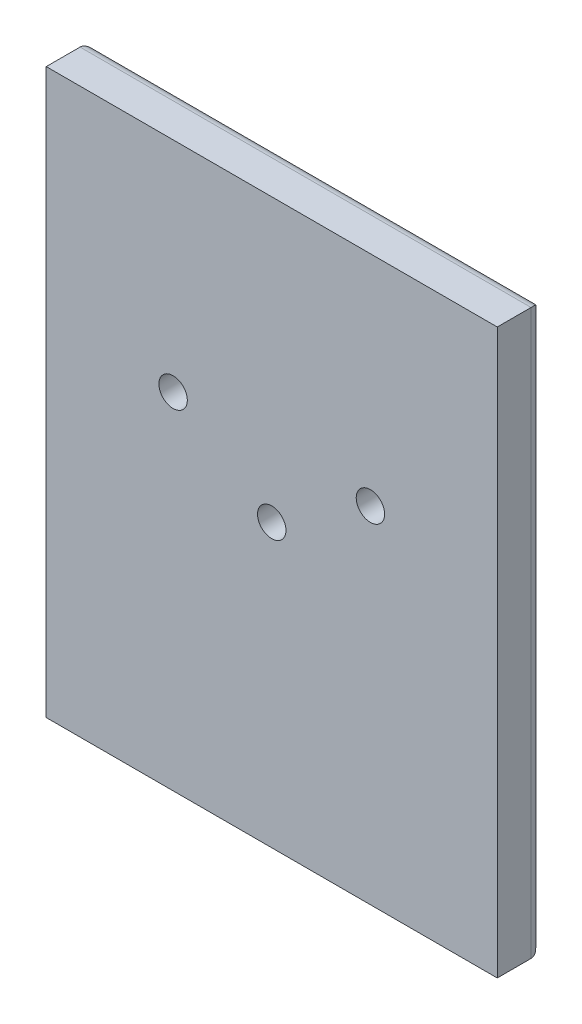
from build123d import *

# Parameters (mm, degrees)
SKETCH1_W          = 101.6
SKETCH1_H          = 127
EXTRUDE1_DEPTH     = 10.16
FILLET1_R          = 2.54
SKETCH3_R          = 3.2004
CUT_EXTRUDE1_DEPTH = 135.434164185


with BuildPart() as part:
    # Sketch1 → Extrude1 (new body)
    with BuildSketch(Plane.XY):
        with Locations((7.62, -57.15)):
            Rectangle(SKETCH1_W, SKETCH1_H)
    extrude(amount=EXTRUDE1_DEPTH)

    # Fillet1
    fillet1_edges = [part.edges().sort_by_distance(p)[0] for p in [
        (7.62, -120.65, 0),
        (-43.18, -57.15, 0),
        (7.62, 6.35, 0),
        (58.42, -57.15, 0),
    ]]
    fillet(fillet1_edges, radius=FILLET1_R)

    # Sketch3 → Cut-Extrude1 (cut, through all)
    with BuildSketch(Plane(origin=(0, 0, 0), x_dir=(-1, 0, 0), z_dir=(0, 0, -1))):
        with Locations((-7.62, -57.15)):
            Circle(SKETCH3_R)
        with Locations((-29.845, -42.8625)):
            Circle(SKETCH3_R)
        with Locations((14.605, -42.8625)):
            Circle(SKETCH3_R)
    extrude(amount=-CUT_EXTRUDE1_DEPTH, mode=Mode.SUBTRACT)


solid = part.part
